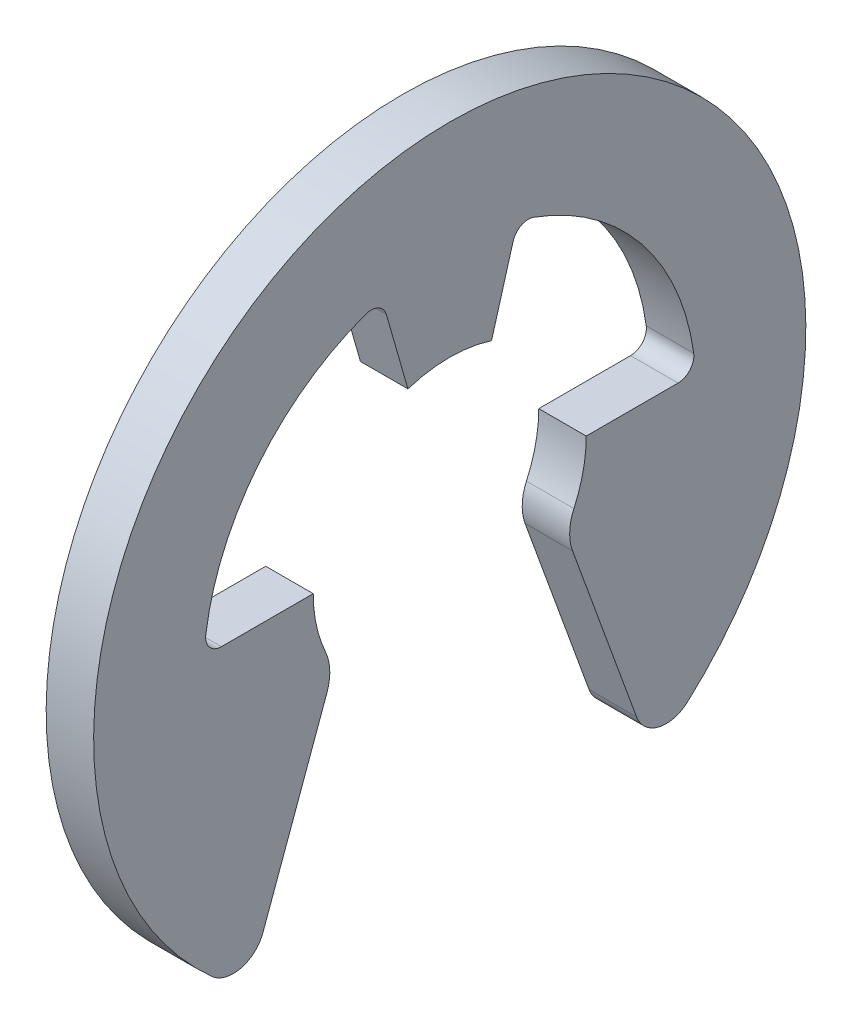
from build123d import *

# Parameters (mm, degrees)
BASE_EXTRUSION_DEPTH = 0.4


with BuildPart() as part:
    # Esquisse1 → Base-Extrusion (new body)
    with BuildSketch(Plane(origin=(0, 0, 0), x_dir=(0, 0, -1), z_dir=(1, 0, 0))):
        with BuildLine():
            Line((0.352149, 1.228089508), (0.533932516, 1.862043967))
            ThreePointArc((0.533932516, 1.862043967), (0.601503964, 1.944060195), (0.707566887, 1.950634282))
            ThreePointArc((0.707566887, 1.950634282), (1.613075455, 1.305225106), (2.055337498, 0.284978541))
            ThreePointArc((2.055337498, 0.284978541), (2.023814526, 0.179098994), (1.923267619, 0.133333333))
            Line((1.923267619, 0.133333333), (1.15, 0.133333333))
            ThreePointArc((1.15, 0.133333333), (1.123793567, -0.110773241), (1.046368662, -0.343754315))
            ThreePointArc((1.046368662, -0.343754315), (1.010632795, -0.493957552), (1.03444593, -0.646505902))
            Line((1.03444593, -0.646505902), (1.57330776, -2.127016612))
            ThreePointArc((1.57330776, -2.127016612), (1.759057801, -2.294476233), (2.001833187, -2.234426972))
            ThreePointArc((2.001833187, -2.234426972), (0, 3), (-2.001833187, -2.234426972))
            ThreePointArc((-2.001833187, -2.234426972), (-1.759057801, -2.294476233), (-1.57330776, -2.127016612))
            Line((-1.57330776, -2.127016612), (-1.03444593, -0.646505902))
            ThreePointArc((-1.03444593, -0.646505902), (-1.010632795, -0.493957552), (-1.046368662, -0.343754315))
            ThreePointArc((-1.046368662, -0.343754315), (-1.123793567, -0.110773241), (-1.15, 0.133333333))
            Line((-1.15, 0.133333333), (-1.923267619, 0.133333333))
            ThreePointArc((-1.923267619, 0.133333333), (-2.023814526, 0.179098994), (-2.055337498, 0.284978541))
            ThreePointArc((-2.055337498, 0.284978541), (-1.613075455, 1.305225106), (-0.707566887, 1.950634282))
            ThreePointArc((-0.707566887, 1.950634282), (-0.601503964, 1.944060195), (-0.533932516, 1.862043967))
            Line((-0.533932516, 1.862043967), (-0.352149, 1.228089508))
            ThreePointArc((-0.352149, 1.228089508), (0, 1.283333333), (0.352149, 1.228089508))
        make_face()
    extrude(amount=BASE_EXTRUSION_DEPTH)


solid = part.part
